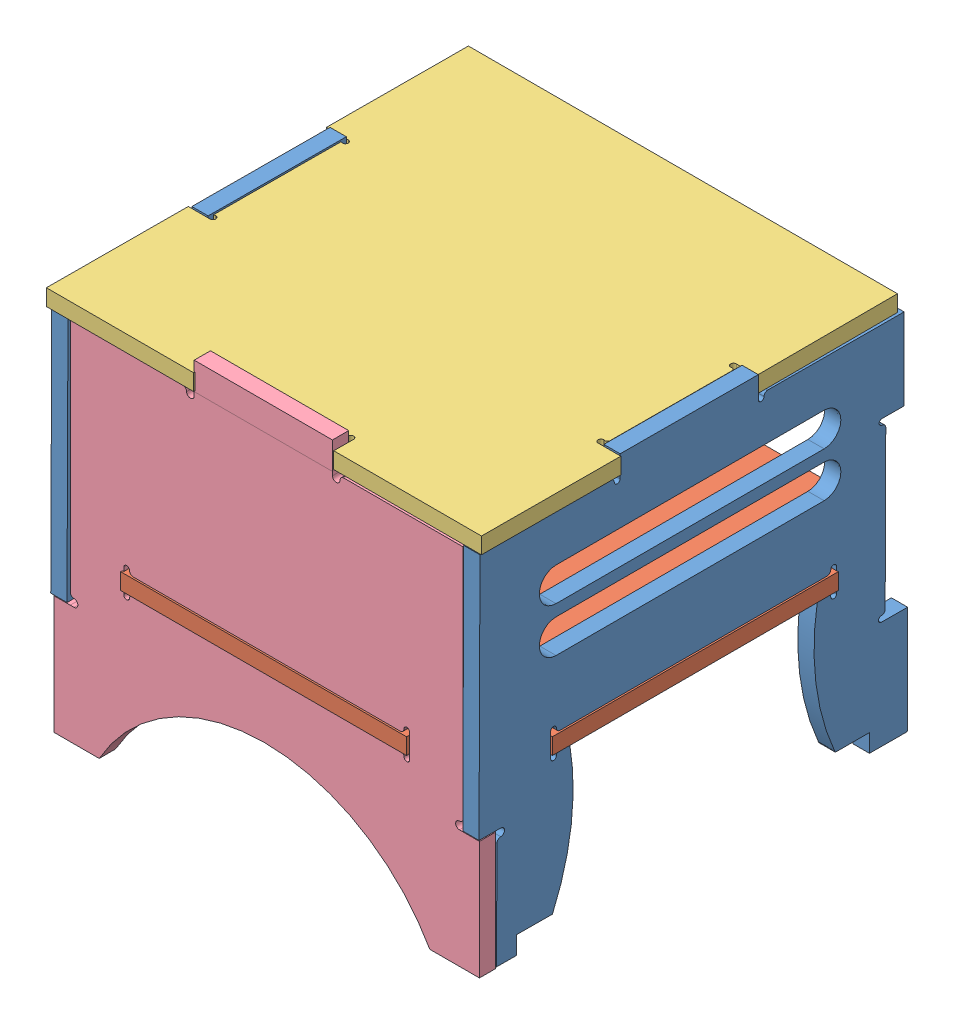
SolidWorks assembly Assem1.SLDASM, configuration Default (file format 9000). Lengths in mm.
Overall size (453.42 411.03 451.51).
5 component instances, 4 part files, 12 mates.
Components (placement in the parent):
- Side Part-1: Side Part.SLDPRT [Default] at (-281.0325 -179.5425 996.7179) x (0 0 -1) z (1 0 0) size (448.29 401.83 17)
- TopMiddle Part-1: TopMiddle Part.SLDPRT [Default] at (-57.628 -3.4418 1028.132) x (-1 0 0) z (0 1 0) size (451.51 451.51 17)
- TopMiddle2 Part-1: TopMiddle2 Part.SLDPRT [Default] at (-39.9936 230.2382 704.9741) x (1 0 0) z (0 -0.999992 0.003924) size (452.36 441.34 17)
- Side Part-2: Side Part.SLDPRT [Default] at (149.8816 -179.5425 996.7326) x (0 0 -1) z (1 0 0) size (448.29 401.83 17)
- Back Closure-2: Back Closure.SLDPRT [Default] at (-278.0284 -168.6077 981.9246) size (444.91 410.43 17)
Mates (geometry in assembly coordinates):
- Coincident61: coincident anti-aligned: plane of Side Part-1 through (-264.0325 -7.3949 914.4957) normal (1 0 0); plane of TopMiddle Part-1 through (-264.0325 13.5582 1028.132) normal (-1 0 0)
- Coincident62: coincident anti-aligned: plane of Side Part-1 through (-264.0325 13.5582 914.4957) normal (0 -1 0); plane of TopMiddle Part-1 through (-57.628 13.5582 1028.132) normal (0 1 0)
- Coincident63: coincident anti-aligned: plane of Side Part-1 through (-264.0325 17.5152 625.4675) normal (0 0 1); plane of TopMiddle Part-1 through (-57.628 13.5582 625.4675) normal (0 0 -1)
- Coincident64: coincident anti-aligned: plane of TopMiddle Part-1 through (149.8816 13.5582 1028.132) normal (1 0 0); plane of Side Part-2 through (149.8816 -7.3949 914.5105) normal (-1 0 0)
- Coincident66: coincident anti-aligned: plane of TopMiddle Part-1 through (-57.628 13.5582 1028.132) normal (0 1 0); plane of Side Part-2 through (166.8816 13.5582 914.5105) normal (0 -1 0)
- Coincident67: coincident anti-aligned: plane of TopMiddle Part-1 through (-57.628 13.5582 924.4675) normal (0 0 1); plane of Side Part-2 through (166.8816 -7.3949 924.4675) normal (0 0 -1)
- Coincident68: coincident anti-aligned: plane of TopMiddle Part-1 through (-57.628 13.5582 1028.132) normal (0 1 0); plane of Back Closure-2 through (-278.0284 13.5582 998.9246) normal (0 -1 0)
- Coincident69: coincident anti-aligned: plane of Side Part-2 through (149.8816 -7.3949 914.5105) normal (-1 0 0); plane of Back Closure-2 through (149.8816 -168.6077 998.9246) normal (1 0 0)
- Coincident70: coincident anti-aligned: plane of TopMiddle Part-1 through (-57.628 13.5582 981.9246) normal (0 0 1); plane of Back Closure-2 through (-278.0284 -168.6077 981.9246) normal (0 0 -1)
- Coincident71: coincident anti-aligned: plane of TopMiddle2 Part-1 through (143.8078 213.259 710.3108) normal (0 -0.999992 0.003924); plane of Side Part-2 through (166.8816 212.6488 554.8071) normal (0 0.999992 -0.003924)
- Coincident79: coincident anti-aligned: plane of TopMiddle2 Part-1 through (13.1316 214.3864 997.6196) normal (-1 0 0); plane of Back Closure-2 through (13.1316 213.3223 981.9246) normal (1 0 0)
- Coincident80: coincident anti-aligned: plane of Side Part-1 through (-264.0325 232.6255 851.7958) normal (0 0.003924 0.999992); plane of TopMiddle2 Part-1 through (-284.7464 213.8145 851.8697) normal (0 -0.003924 -0.999992)
